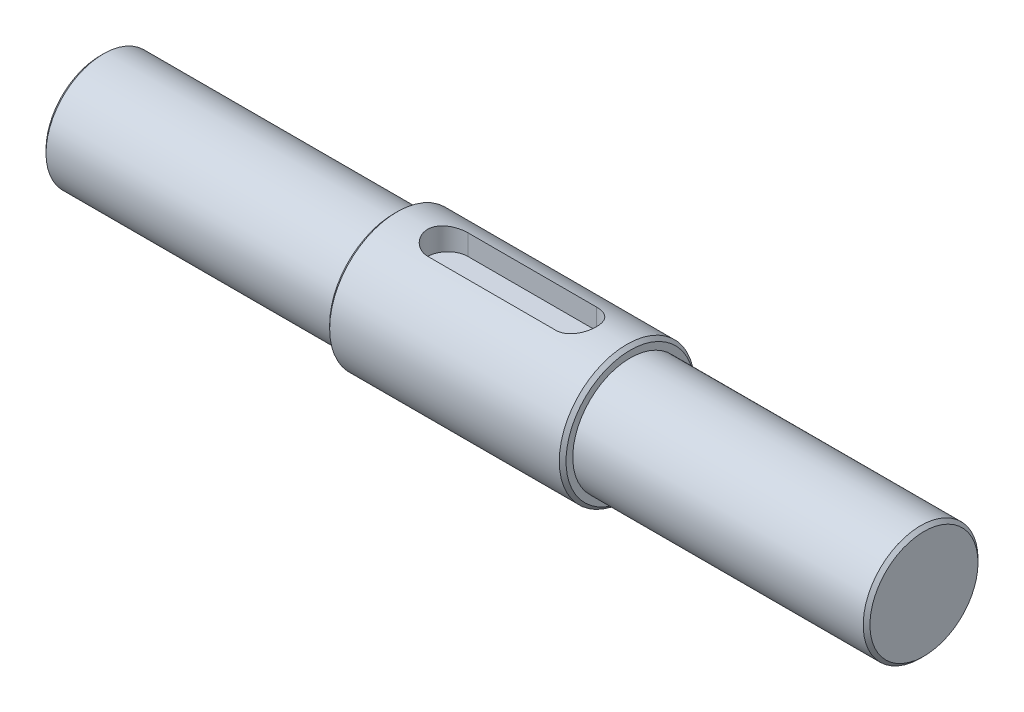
ISO-10303-21;
HEADER;
FILE_DESCRIPTION(('STEP AP214'),'2;1');
FILE_NAME('part.step','',(''),(''),'','','');
FILE_SCHEMA(('AUTOMOTIVE_DESIGN { 1 0 10303 214 1 1 1 1 }'));
ENDSEC;
DATA;
#1=APPLICATION_CONTEXT('core data for automotive mechanical design processes');
#2=APPLICATION_PROTOCOL_DEFINITION('international standard','automotive_design',2000,#1);
#3=PRODUCT_CONTEXT('',#1,'mechanical');
#4=PRODUCT('Part','Part','',(#3));
#5=PRODUCT_RELATED_PRODUCT_CATEGORY('part','',(#4));
#6=PRODUCT_DEFINITION_FORMATION('','',#4);
#7=PRODUCT_DEFINITION_CONTEXT('part definition',#1,'design');
#8=PRODUCT_DEFINITION('design','',#6,#7);
#9=PRODUCT_DEFINITION_SHAPE('','',#8);
#10=(LENGTH_UNIT() NAMED_UNIT(*) SI_UNIT(.MILLI.,.METRE.));
#11=(NAMED_UNIT(*) PLANE_ANGLE_UNIT() SI_UNIT($,.RADIAN.));
#12=(NAMED_UNIT(*) SI_UNIT($,.STERADIAN.) SOLID_ANGLE_UNIT());
#13=UNCERTAINTY_MEASURE_WITH_UNIT(LENGTH_MEASURE(1.E-05),#10,'distance_accuracy_value','');
#14=(GEOMETRIC_REPRESENTATION_CONTEXT(3) GLOBAL_UNCERTAINTY_ASSIGNED_CONTEXT((#13)) GLOBAL_UNIT_ASSIGNED_CONTEXT((#10,
#11,#12)) REPRESENTATION_CONTEXT('',''));
#15=CARTESIAN_POINT('',(0.,0.,0.));
#16=DIRECTION('',(0.,0.,1.));
#17=DIRECTION('',(1.,0.,0.));
#18=AXIS2_PLACEMENT_3D('',#15,#16,#17);
#19=CARTESIAN_POINT('',(78.5,0.,0.));
#20=DIRECTION('',(-1.,0.,0.));
#21=DIRECTION('',(0.,0.,1.));
#22=AXIS2_PLACEMENT_3D('',#19,#20,#21);
#23=CYLINDRICAL_SURFACE('',#22,10.);
#24=CARTESIAN_POINT('',(44.,0.,0.));
#25=DIRECTION('',(-1.,0.,0.));
#26=DIRECTION('',(0.,0.,1.));
#27=AXIS2_PLACEMENT_3D('',#24,#25,#26);
#28=CIRCLE('',#27,10.);
#29=CARTESIAN_POINT('',(44.,0.,10.));
#30=VERTEX_POINT('',#29);
#31=EDGE_CURVE('E175',#30,#30,#28,.F.);
#32=ORIENTED_EDGE('',*,*,#31,.T.);
#33=EDGE_LOOP('',(#32));
#34=FACE_BOUND('',#33,.T.);
#35=CARTESIAN_POINT('',(78.,0.,0.));
#36=DIRECTION('',(1.,0.,0.));
#37=DIRECTION('',(0.,0.,-1.));
#38=AXIS2_PLACEMENT_3D('',#35,#36,#37);
#39=CIRCLE('',#38,10.);
#40=CARTESIAN_POINT('',(78.,0.,-10.));
#41=VERTEX_POINT('',#40);
#42=EDGE_CURVE('E179',#41,#41,#39,.F.);
#43=ORIENTED_EDGE('',*,*,#42,.T.);
#44=EDGE_LOOP('',(#43));
#45=FACE_BOUND('',#44,.T.);
#46=CARTESIAN_POINT('',(70.5,9.53939201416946,-3.));
#47=CARTESIAN_POINT('',(70.5823355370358,9.53938054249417,-3.00001027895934));
#48=CARTESIAN_POINT('',(70.6646644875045,9.54045772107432,-2.9966106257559));
#49=CARTESIAN_POINT('',(70.8286940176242,9.54470412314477,-2.98307142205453));
#50=CARTESIAN_POINT('',(70.9103947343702,9.54787287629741,-2.97293338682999));
#51=CARTESIAN_POINT('',(71.0723849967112,9.55620668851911,-2.94603139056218));
#52=CARTESIAN_POINT('',(71.1526775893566,9.56136667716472,-2.92928425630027));
#53=CARTESIAN_POINT('',(71.3114758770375,9.57351626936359,-2.88932851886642));
#54=CARTESIAN_POINT('',(71.3899815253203,9.58050592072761,-2.86611974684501));
#55=CARTESIAN_POINT('',(71.6219518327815,9.60391662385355,-2.78708502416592));
#56=CARTESIAN_POINT('',(71.77207318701,9.62279067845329,-2.72181653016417));
#57=CARTESIAN_POINT('',(72.0592304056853,9.66493287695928,-2.56814755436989));
#58=CARTESIAN_POINT('',(72.1962605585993,9.6882029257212,-2.47973703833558));
#59=CARTESIAN_POINT('',(72.4577106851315,9.73733420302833,-2.27930849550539));
#60=CARTESIAN_POINT('',(72.5816617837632,9.76325026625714,-2.16669112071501));
#61=CARTESIAN_POINT('',(72.809254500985,9.81429160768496,-1.92230070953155));
#62=CARTESIAN_POINT('',(72.9128889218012,9.83941660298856,-1.7905209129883));
#63=CARTESIAN_POINT('',(73.0989716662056,9.88667632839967,-1.50815545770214));
#64=CARTESIAN_POINT('',(73.1809274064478,9.90873687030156,-1.35723196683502));
#65=CARTESIAN_POINT('',(73.3180322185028,9.94670462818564,-1.0430686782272));
#66=CARTESIAN_POINT('',(73.3732138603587,9.96261931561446,-0.879844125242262));
#67=CARTESIAN_POINT('',(73.44253583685,9.98287579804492,-0.596548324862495));
#68=CARTESIAN_POINT('',(73.4640437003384,9.98926260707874,-0.478373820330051));
#69=CARTESIAN_POINT('',(73.4927780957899,9.99782637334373,-0.240148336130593));
#70=CARTESIAN_POINT('',(73.5000051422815,10.0000034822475,-0.120097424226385));
#71=CARTESIAN_POINT('',(73.4999929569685,9.99999523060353,0.164489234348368));
#72=CARTESIAN_POINT('',(73.4864191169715,9.99589991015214,0.329065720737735));
#73=CARTESIAN_POINT('',(73.4325826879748,9.97995006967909,0.653490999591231));
#74=CARTESIAN_POINT('',(73.3922962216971,9.96808860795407,0.813335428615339));
#75=CARTESIAN_POINT('',(73.2865050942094,9.93791009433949,1.12347011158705));
#76=CARTESIAN_POINT('',(73.2210439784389,9.91960419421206,1.27377634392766));
#77=CARTESIAN_POINT('',(73.0669193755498,9.87844006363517,1.56126220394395));
#78=CARTESIAN_POINT('',(72.9782550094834,9.85558166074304,1.69844133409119));
#79=CARTESIAN_POINT('',(72.7775549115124,9.80701538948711,1.95973986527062));
#80=CARTESIAN_POINT('',(72.66497372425,9.78124908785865,2.08342941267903));
#81=CARTESIAN_POINT('',(72.4207873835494,9.73011795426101,2.31049322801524));
#82=CARTESIAN_POINT('',(72.2891780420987,9.70475321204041,2.41386301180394));
#83=CARTESIAN_POINT('',(72.0070161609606,9.65667462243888,2.59963060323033));
#84=CARTESIAN_POINT('',(71.8561002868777,9.63403435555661,2.68149682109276));
#85=CARTESIAN_POINT('',(71.5418990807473,9.59486058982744,2.81846673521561));
#86=CARTESIAN_POINT('',(71.3786248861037,9.57832166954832,2.87359420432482));
#87=CARTESIAN_POINT('',(71.0954604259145,9.5572566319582,2.94274437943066));
#88=CARTESIAN_POINT('',(70.9774850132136,9.5506065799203,2.96417022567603));
#89=CARTESIAN_POINT('',(70.7396975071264,9.5416523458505,2.9928130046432));
#90=CARTESIAN_POINT('',(70.6198859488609,9.539346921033,3.0000340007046));
#91=CARTESIAN_POINT('',(70.5,9.53939201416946,3.));
#92=B_SPLINE_CURVE_WITH_KNOTS('',3,(#46,#47,#48,#49,#50,#51,#52,#53,#54,#55,#56,#57,#58,#59,#60,
#61,#62,#63,#64,#65,#66,#67,#68,#69,#70,#71,#72,#73,#74,#75,#76,#77,#78,#79,#80,#81,#82,#83,#84,
#85,#86,#87,#88,#89,#90,#91),.UNSPECIFIED.,.F.,.F.,(4,2,2,2,2,2,2,2,2,2,2,2,2,2,2,2,2,2,2,2,2,2,
4),(0.,0.24691819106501,0.493780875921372,0.740019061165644,0.986263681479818,1.47814125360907,
1.9702324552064,2.47630442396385,2.9825553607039,3.49947665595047,4.01576754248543,
4.37574541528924,4.73571031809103,5.22872964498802,5.72219025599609,6.2148011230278,
6.70743065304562,7.21280916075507,7.71829906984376,8.23530810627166,8.75185663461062,
9.11124123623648,9.47052301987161),.UNSPECIFIED.);
#93=CARTESIAN_POINT('',(70.5,9.53939201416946,-3.));
#94=VERTEX_POINT('',#93);
#95=CARTESIAN_POINT('',(70.5,9.53939201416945,3.));
#96=VERTEX_POINT('',#95);
#97=EDGE_CURVE('E98',#94,#96,#92,.T.);
#98=ORIENTED_EDGE('',*,*,#97,.T.);
#99=DIRECTION('',(-1.,0.,0.));
#100=VECTOR('',#99,1.);
#101=CARTESIAN_POINT('',(61.,9.53939201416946,3.));
#102=LINE('',#101,#100);
#103=CARTESIAN_POINT('',(51.5,9.53939201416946,3.));
#104=VERTEX_POINT('',#103);
#105=EDGE_CURVE('E123',#96,#104,#102,.T.);
#106=ORIENTED_EDGE('',*,*,#105,.T.);
#107=CARTESIAN_POINT('',(51.5,9.53939201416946,3.));
#108=CARTESIAN_POINT('',(51.4176644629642,9.53938054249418,3.00001027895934));
#109=CARTESIAN_POINT('',(51.3353355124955,9.54045772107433,2.99661062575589));
#110=CARTESIAN_POINT('',(51.1713059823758,9.54470412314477,2.98307142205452));
#111=CARTESIAN_POINT('',(51.0896052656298,9.54787287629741,2.97293338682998));
#112=CARTESIAN_POINT('',(50.9276150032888,9.55620668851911,2.94603139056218));
#113=CARTESIAN_POINT('',(50.8473224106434,9.56136667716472,2.92928425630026));
#114=CARTESIAN_POINT('',(50.6885241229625,9.5735162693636,2.88932851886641));
#115=CARTESIAN_POINT('',(50.6100184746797,9.58050592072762,2.866119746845));
#116=CARTESIAN_POINT('',(50.3780481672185,9.60391662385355,2.78708502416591));
#117=CARTESIAN_POINT('',(50.22792681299,9.6227906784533,2.72181653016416));
#118=CARTESIAN_POINT('',(49.9407695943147,9.66493287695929,2.56814755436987));
#119=CARTESIAN_POINT('',(49.8037394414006,9.68820292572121,2.47973703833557));
#120=CARTESIAN_POINT('',(49.5422893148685,9.73733420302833,2.27930849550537));
#121=CARTESIAN_POINT('',(49.4183382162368,9.76325026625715,2.16669112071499));
#122=CARTESIAN_POINT('',(49.190745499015,9.81429160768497,1.92230070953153));
#123=CARTESIAN_POINT('',(49.0871110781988,9.83941660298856,1.79052091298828));
#124=CARTESIAN_POINT('',(48.9010283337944,9.88667632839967,1.50815545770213));
#125=CARTESIAN_POINT('',(48.8190725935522,9.90873687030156,1.35723196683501));
#126=CARTESIAN_POINT('',(48.6819677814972,9.94670462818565,1.0430686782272));
#127=CARTESIAN_POINT('',(48.6267861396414,9.96261931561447,0.879844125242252));
#128=CARTESIAN_POINT('',(48.55746416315,9.98287579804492,0.596548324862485));
#129=CARTESIAN_POINT('',(48.5359562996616,9.98926260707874,0.478373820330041));
#130=CARTESIAN_POINT('',(48.5072219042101,9.99782637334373,0.240148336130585));
#131=CARTESIAN_POINT('',(48.4999948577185,10.0000034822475,0.120097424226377));
#132=CARTESIAN_POINT('',(48.5000070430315,9.99999523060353,-0.164489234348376));
#133=CARTESIAN_POINT('',(48.5135808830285,9.99589991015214,-0.329065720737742));
#134=CARTESIAN_POINT('',(48.5674173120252,9.97995006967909,-0.653490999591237));
#135=CARTESIAN_POINT('',(48.607703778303,9.96808860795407,-0.813335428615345));
#136=CARTESIAN_POINT('',(48.7134949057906,9.93791009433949,-1.12347011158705));
#137=CARTESIAN_POINT('',(48.7789560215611,9.91960419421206,-1.27377634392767));
#138=CARTESIAN_POINT('',(48.9330806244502,9.87844006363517,-1.56126220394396));
#139=CARTESIAN_POINT('',(49.0217449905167,9.85558166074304,-1.69844133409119));
#140=CARTESIAN_POINT('',(49.2224450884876,9.80701538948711,-1.95973986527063));
#141=CARTESIAN_POINT('',(49.33502627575,9.78124908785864,-2.08342941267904));
#142=CARTESIAN_POINT('',(49.5792126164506,9.73011795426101,-2.31049322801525));
#143=CARTESIAN_POINT('',(49.7108219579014,9.70475321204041,-2.41386301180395));
#144=CARTESIAN_POINT('',(49.9929838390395,9.65667462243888,-2.59963060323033));
#145=CARTESIAN_POINT('',(50.1438997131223,9.63403435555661,-2.68149682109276));
#146=CARTESIAN_POINT('',(50.4581009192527,9.59486058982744,-2.81846673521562));
#147=CARTESIAN_POINT('',(50.6213751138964,9.57832166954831,-2.87359420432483));
#148=CARTESIAN_POINT('',(50.9045395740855,9.5572566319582,-2.94274437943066));
#149=CARTESIAN_POINT('',(51.0225149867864,9.5506065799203,-2.96417022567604));
#150=CARTESIAN_POINT('',(51.2603024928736,9.54165234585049,-2.99281300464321));
#151=CARTESIAN_POINT('',(51.3801140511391,9.539346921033,-3.00003400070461));
#152=CARTESIAN_POINT('',(51.5,9.53939201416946,-3.));
#153=B_SPLINE_CURVE_WITH_KNOTS('',3,(#107,#108,#109,#110,#111,#112,#113,#114,#115,#116,#117,
#118,#119,#120,#121,#122,#123,#124,#125,#126,#127,#128,#129,#130,#131,#132,#133,#134,#135,#136,
#137,#138,#139,#140,#141,#142,#143,#144,#145,#146,#147,#148,#149,#150,#151,#152),.UNSPECIFIED.,
.F.,.F.,(4,2,2,2,2,2,2,2,2,2,2,2,2,2,2,2,2,2,2,2,2,2,4),(0.,0.246918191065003,0.493780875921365,
0.74001906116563,0.986263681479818,1.4781412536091,1.97023245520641,2.47630442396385,
2.98255536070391,3.49947665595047,4.01576754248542,4.37574541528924,4.73571031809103,
5.22872964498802,5.72219025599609,6.21480112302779,6.70743065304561,7.21280916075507,
7.71829906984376,8.23530810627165,8.75185663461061,9.11124123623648,9.47052301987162),.UNSPECIFIED.);
#154=CARTESIAN_POINT('',(51.5,9.53939201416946,-3.));
#155=VERTEX_POINT('',#154);
#156=EDGE_CURVE('E61',#104,#155,#153,.T.);
#157=ORIENTED_EDGE('',*,*,#156,.T.);
#158=DIRECTION('',(-1.,0.,0.));
#159=VECTOR('',#158,1.);
#160=CARTESIAN_POINT('',(61.,9.53939201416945,-3.00000000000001));
#161=LINE('',#160,#159);
#162=EDGE_CURVE('E91',#155,#94,#161,.F.);
#163=ORIENTED_EDGE('',*,*,#162,.T.);
#164=EDGE_LOOP('',(#98,#106,#157,#163));
#165=FACE_BOUND('',#164,.T.);
#166=ADVANCED_FACE('F45',(#34,#45,#165),#23,.T.);
#167=CARTESIAN_POINT('',(78.5,10.,0.));
#168=DIRECTION('',(1.,0.,0.));
#169=DIRECTION('',(0.,0.,-1.));
#170=AXIS2_PLACEMENT_3D('',#167,#168,#169);
#171=PLANE('',#170);
#172=CARTESIAN_POINT('',(78.5,0.,0.));
#173=DIRECTION('',(1.,0.,0.));
#174=DIRECTION('',(0.,0.,-1.));
#175=AXIS2_PLACEMENT_3D('',#172,#173,#174);
#176=CIRCLE('',#175,9.49999999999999);
#177=CARTESIAN_POINT('',(78.5,0.,-9.49999999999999));
#178=VERTEX_POINT('',#177);
#179=EDGE_CURVE('E11',#178,#178,#176,.T.);
#180=ORIENTED_EDGE('',*,*,#179,.T.);
#181=EDGE_LOOP('',(#180));
#182=FACE_BOUND('',#181,.T.);
#183=CARTESIAN_POINT('',(78.5,0.,0.));
#184=DIRECTION('',(1.,0.,0.));
#185=DIRECTION('',(0.,0.,-1.));
#186=AXIS2_PLACEMENT_3D('',#183,#184,#185);
#187=CIRCLE('',#186,8.5);
#188=CARTESIAN_POINT('',(78.5,0.,-8.5));
#189=VERTEX_POINT('',#188);
#190=EDGE_CURVE('E198',#189,#189,#187,.T.);
#191=ORIENTED_EDGE('',*,*,#190,.F.);
#192=EDGE_LOOP('',(#191));
#193=FACE_BOUND('',#192,.T.);
#194=ADVANCED_FACE('F145',(#182,#193),#171,.T.);
#195=CARTESIAN_POINT('',(43.5,0.,0.));
#196=DIRECTION('',(-1.,0.,0.));
#197=DIRECTION('',(0.,0.,1.));
#198=AXIS2_PLACEMENT_3D('',#195,#196,#197);
#199=PLANE('',#198);
#200=CARTESIAN_POINT('',(43.5,0.,0.));
#201=DIRECTION('',(-1.,0.,0.));
#202=DIRECTION('',(0.,0.,1.));
#203=AXIS2_PLACEMENT_3D('',#200,#201,#202);
#204=CIRCLE('',#203,9.50000000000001);
#205=CARTESIAN_POINT('',(43.5,0.,9.50000000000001));
#206=VERTEX_POINT('',#205);
#207=EDGE_CURVE('E185',#206,#206,#204,.T.);
#208=ORIENTED_EDGE('',*,*,#207,.T.);
#209=EDGE_LOOP('',(#208));
#210=FACE_BOUND('',#209,.T.);
#211=CARTESIAN_POINT('',(43.5,0.,0.));
#212=DIRECTION('',(-1.,0.,0.));
#213=DIRECTION('',(0.,0.,1.));
#214=AXIS2_PLACEMENT_3D('',#211,#212,#213);
#215=CIRCLE('',#214,8.5);
#216=CARTESIAN_POINT('',(43.5,0.,8.5));
#217=VERTEX_POINT('',#216);
#218=EDGE_CURVE('E197',#217,#217,#215,.T.);
#219=ORIENTED_EDGE('',*,*,#218,.F.);
#220=EDGE_LOOP('',(#219));
#221=FACE_BOUND('',#220,.T.);
#222=ADVANCED_FACE('F151',(#210,#221),#199,.T.);
#223=CARTESIAN_POINT('',(122.,0.,0.));
#224=DIRECTION('',(-1.,0.,0.));
#225=DIRECTION('',(0.,0.,1.));
#226=AXIS2_PLACEMENT_3D('',#223,#224,#225);
#227=CYLINDRICAL_SURFACE('',#226,8.5);
#228=CARTESIAN_POINT('',(121.5,0.,0.));
#229=DIRECTION('',(1.,0.,0.));
#230=DIRECTION('',(0.,0.,-1.));
#231=AXIS2_PLACEMENT_3D('',#228,#229,#230);
#232=CIRCLE('',#231,8.5);
#233=CARTESIAN_POINT('',(121.5,0.,-8.5));
#234=VERTEX_POINT('',#233);
#235=EDGE_CURVE('E54',#234,#234,#232,.F.);
#236=ORIENTED_EDGE('',*,*,#235,.T.);
#237=EDGE_LOOP('',(#236));
#238=FACE_BOUND('',#237,.T.);
#239=ORIENTED_EDGE('',*,*,#190,.T.);
#240=EDGE_LOOP('',(#239));
#241=FACE_BOUND('',#240,.T.);
#242=ADVANCED_FACE('F255',(#238,#241),#227,.T.);
#243=CARTESIAN_POINT('',(122.,0.,0.));
#244=DIRECTION('',(1.,0.,0.));
#245=DIRECTION('',(0.,0.,-1.));
#246=AXIS2_PLACEMENT_3D('',#243,#244,#245);
#247=PLANE('',#246);
#248=CARTESIAN_POINT('',(122.,0.,0.));
#249=DIRECTION('',(1.,0.,0.));
#250=DIRECTION('',(0.,0.,-1.));
#251=AXIS2_PLACEMENT_3D('',#248,#249,#250);
#252=CIRCLE('',#251,8.00000000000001);
#253=CARTESIAN_POINT('',(122.,0.,-8.00000000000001));
#254=VERTEX_POINT('',#253);
#255=EDGE_CURVE('E172',#254,#254,#252,.T.);
#256=ORIENTED_EDGE('',*,*,#255,.T.);
#257=EDGE_LOOP('',(#256));
#258=FACE_BOUND('',#257,.T.);
#259=ADVANCED_FACE('F251',(#258),#247,.T.);
#260=CARTESIAN_POINT('',(0.,0.,0.));
#261=DIRECTION('',(1.,0.,0.));
#262=DIRECTION('',(0.,0.,-1.));
#263=AXIS2_PLACEMENT_3D('',#260,#261,#262);
#264=CYLINDRICAL_SURFACE('',#263,8.5);
#265=CARTESIAN_POINT('',(0.500000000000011,0.,0.));
#266=DIRECTION('',(-1.,0.,0.));
#267=DIRECTION('',(0.,0.,1.));
#268=AXIS2_PLACEMENT_3D('',#265,#266,#267);
#269=CIRCLE('',#268,8.5);
#270=CARTESIAN_POINT('',(0.500000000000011,0.,8.5));
#271=VERTEX_POINT('',#270);
#272=EDGE_CURVE('E189',#271,#271,#269,.F.);
#273=ORIENTED_EDGE('',*,*,#272,.T.);
#274=EDGE_LOOP('',(#273));
#275=FACE_BOUND('',#274,.T.);
#276=ORIENTED_EDGE('',*,*,#218,.T.);
#277=EDGE_LOOP('',(#276));
#278=FACE_BOUND('',#277,.T.);
#279=ADVANCED_FACE('F247',(#275,#278),#264,.T.);
#280=CARTESIAN_POINT('',(0.,0.,0.));
#281=DIRECTION('',(-1.,0.,0.));
#282=DIRECTION('',(0.,0.,1.));
#283=AXIS2_PLACEMENT_3D('',#280,#281,#282);
#284=PLANE('',#283);
#285=CARTESIAN_POINT('',(0.,0.,0.));
#286=DIRECTION('',(-1.,0.,0.));
#287=DIRECTION('',(0.,0.,1.));
#288=AXIS2_PLACEMENT_3D('',#285,#286,#287);
#289=CIRCLE('',#288,8.00000000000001);
#290=CARTESIAN_POINT('',(0.,0.,8.00000000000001));
#291=VERTEX_POINT('',#290);
#292=EDGE_CURVE('E193',#291,#291,#289,.T.);
#293=ORIENTED_EDGE('',*,*,#292,.T.);
#294=EDGE_LOOP('',(#293));
#295=FACE_BOUND('',#294,.T.);
#296=ADVANCED_FACE('F244',(#295),#284,.T.);
#297=CARTESIAN_POINT('',(70.5,10.001,0.));
#298=DIRECTION('',(0.,-1.,0.));
#299=DIRECTION('',(0.,0.,-1.));
#300=AXIS2_PLACEMENT_3D('',#297,#298,#299);
#301=CYLINDRICAL_SURFACE('',#300,3.);
#302=ORIENTED_EDGE('',*,*,#97,.F.);
#303=DIRECTION('',(0.,-1.,0.));
#304=VECTOR('',#303,1.);
#305=CARTESIAN_POINT('',(70.5,10.001,-3.));
#306=LINE('',#305,#304);
#307=CARTESIAN_POINT('',(70.5,6.50000000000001,-3.));
#308=VERTEX_POINT('',#307);
#309=EDGE_CURVE('E88',#94,#308,#306,.T.);
#310=ORIENTED_EDGE('',*,*,#309,.T.);
#311=CARTESIAN_POINT('',(70.5,6.50000000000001,0.));
#312=DIRECTION('',(0.,-1.,0.));
#313=DIRECTION('',(0.,0.,-1.));
#314=AXIS2_PLACEMENT_3D('',#311,#312,#313);
#315=CIRCLE('',#314,3.);
#316=CARTESIAN_POINT('',(70.5,6.50000000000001,3.));
#317=VERTEX_POINT('',#316);
#318=EDGE_CURVE('E208',#308,#317,#315,.T.);
#319=ORIENTED_EDGE('',*,*,#318,.T.);
#320=DIRECTION('',(0.,-1.,0.));
#321=VECTOR('',#320,1.);
#322=CARTESIAN_POINT('',(70.5,10.001,3.));
#323=LINE('',#322,#321);
#324=EDGE_CURVE('E69',#96,#317,#323,.T.);
#325=ORIENTED_EDGE('',*,*,#324,.F.);
#326=EDGE_LOOP('',(#302,#310,#319,#325));
#327=FACE_BOUND('',#326,.T.);
#328=ADVANCED_FACE('F99',(#327),#301,.F.);
#329=CARTESIAN_POINT('',(51.5,10.001,-3.));
#330=DIRECTION('',(0.,0.,-1.));
#331=DIRECTION('',(0.,1.,0.));
#332=AXIS2_PLACEMENT_3D('',#329,#330,#331);
#333=PLANE('',#332);
#334=ORIENTED_EDGE('',*,*,#162,.F.);
#335=DIRECTION('',(0.,-1.,0.));
#336=VECTOR('',#335,1.);
#337=CARTESIAN_POINT('',(51.5,10.001,-3.));
#338=LINE('',#337,#336);
#339=CARTESIAN_POINT('',(51.5,6.50000000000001,-3.));
#340=VERTEX_POINT('',#339);
#341=EDGE_CURVE('E209',#155,#340,#338,.T.);
#342=ORIENTED_EDGE('',*,*,#341,.T.);
#343=DIRECTION('',(1.,0.,0.));
#344=VECTOR('',#343,1.);
#345=CARTESIAN_POINT('',(51.5,6.50000000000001,-3.));
#346=LINE('',#345,#344);
#347=EDGE_CURVE('E93',#340,#308,#346,.T.);
#348=ORIENTED_EDGE('',*,*,#347,.T.);
#349=ORIENTED_EDGE('',*,*,#309,.F.);
#350=EDGE_LOOP('',(#334,#342,#348,#349));
#351=FACE_BOUND('',#350,.T.);
#352=ADVANCED_FACE('F89',(#351),#333,.F.);
#353=CARTESIAN_POINT('',(51.5,10.001,0.));
#354=DIRECTION('',(0.,-1.,0.));
#355=DIRECTION('',(0.,0.,-1.));
#356=AXIS2_PLACEMENT_3D('',#353,#354,#355);
#357=CYLINDRICAL_SURFACE('',#356,3.);
#358=ORIENTED_EDGE('',*,*,#156,.F.);
#359=DIRECTION('',(0.,-1.,0.));
#360=VECTOR('',#359,1.);
#361=CARTESIAN_POINT('',(51.5,10.001,3.));
#362=LINE('',#361,#360);
#363=CARTESIAN_POINT('',(51.5,6.50000000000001,3.));
#364=VERTEX_POINT('',#363);
#365=EDGE_CURVE('E205',#104,#364,#362,.T.);
#366=ORIENTED_EDGE('',*,*,#365,.T.);
#367=CARTESIAN_POINT('',(51.5,6.50000000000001,0.));
#368=DIRECTION('',(0.,-1.,0.));
#369=DIRECTION('',(0.,0.,-1.));
#370=AXIS2_PLACEMENT_3D('',#367,#368,#369);
#371=CIRCLE('',#370,3.);
#372=EDGE_CURVE('E228',#364,#340,#371,.T.);
#373=ORIENTED_EDGE('',*,*,#372,.T.);
#374=ORIENTED_EDGE('',*,*,#341,.F.);
#375=EDGE_LOOP('',(#358,#366,#373,#374));
#376=FACE_BOUND('',#375,.T.);
#377=ADVANCED_FACE('F142',(#376),#357,.F.);
#378=CARTESIAN_POINT('',(70.5,10.001,3.));
#379=DIRECTION('',(0.,0.,1.));
#380=DIRECTION('',(0.,-1.,0.));
#381=AXIS2_PLACEMENT_3D('',#378,#379,#380);
#382=PLANE('',#381);
#383=ORIENTED_EDGE('',*,*,#105,.F.);
#384=ORIENTED_EDGE('',*,*,#324,.T.);
#385=DIRECTION('',(-1.,0.,0.));
#386=VECTOR('',#385,1.);
#387=CARTESIAN_POINT('',(70.5,6.50000000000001,3.));
#388=LINE('',#387,#386);
#389=EDGE_CURVE('E225',#317,#364,#388,.T.);
#390=ORIENTED_EDGE('',*,*,#389,.T.);
#391=ORIENTED_EDGE('',*,*,#365,.F.);
#392=EDGE_LOOP('',(#383,#384,#390,#391));
#393=FACE_BOUND('',#392,.T.);
#394=ADVANCED_FACE('F133',(#393),#382,.F.);
#395=CARTESIAN_POINT('',(70.5,6.50000000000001,0.));
#396=DIRECTION('',(0.,-1.,0.));
#397=DIRECTION('',(0.,0.,-1.));
#398=AXIS2_PLACEMENT_3D('',#395,#396,#397);
#399=PLANE('',#398);
#400=ORIENTED_EDGE('',*,*,#318,.F.);
#401=ORIENTED_EDGE('',*,*,#347,.F.);
#402=ORIENTED_EDGE('',*,*,#372,.F.);
#403=ORIENTED_EDGE('',*,*,#389,.F.);
#404=EDGE_LOOP('',(#400,#401,#402,#403));
#405=FACE_BOUND('',#404,.T.);
#406=ADVANCED_FACE('F130',(#405),#399,.F.);
#407=CARTESIAN_POINT('',(0.,0.,0.));
#408=DIRECTION('',(1.,0.,0.));
#409=DIRECTION('',(0.,0.,-1.));
#410=AXIS2_PLACEMENT_3D('',#407,#408,#409);
#411=CONICAL_SURFACE('',#410,8.00000000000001,0.785398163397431);
#412=ORIENTED_EDGE('',*,*,#272,.F.);
#413=EDGE_LOOP('',(#412));
#414=FACE_BOUND('',#413,.T.);
#415=ORIENTED_EDGE('',*,*,#292,.F.);
#416=EDGE_LOOP('',(#415));
#417=FACE_BOUND('',#416,.T.);
#418=ADVANCED_FACE('F132',(#414,#417),#411,.T.);
#419=CARTESIAN_POINT('',(43.5,0.,0.));
#420=DIRECTION('',(1.,0.,0.));
#421=DIRECTION('',(0.,0.,-1.));
#422=AXIS2_PLACEMENT_3D('',#419,#420,#421);
#423=CONICAL_SURFACE('',#422,9.50000000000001,0.785398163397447);
#424=ORIENTED_EDGE('',*,*,#31,.F.);
#425=EDGE_LOOP('',(#424));
#426=FACE_BOUND('',#425,.T.);
#427=ORIENTED_EDGE('',*,*,#207,.F.);
#428=EDGE_LOOP('',(#427));
#429=FACE_BOUND('',#428,.T.);
#430=ADVANCED_FACE('F139',(#426,#429),#423,.T.);
#431=CARTESIAN_POINT('',(122.,0.,0.));
#432=DIRECTION('',(-1.,0.,0.));
#433=DIRECTION('',(0.,0.,1.));
#434=AXIS2_PLACEMENT_3D('',#431,#432,#433);
#435=CONICAL_SURFACE('',#434,8.00000000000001,0.785398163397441);
#436=ORIENTED_EDGE('',*,*,#235,.F.);
#437=EDGE_LOOP('',(#436));
#438=FACE_BOUND('',#437,.T.);
#439=ORIENTED_EDGE('',*,*,#255,.F.);
#440=EDGE_LOOP('',(#439));
#441=FACE_BOUND('',#440,.T.);
#442=ADVANCED_FACE('F159',(#438,#441),#435,.T.);
#443=CARTESIAN_POINT('',(78.,0.,0.));
#444=DIRECTION('',(-1.,0.,0.));
#445=DIRECTION('',(0.,0.,1.));
#446=AXIS2_PLACEMENT_3D('',#443,#444,#445);
#447=CONICAL_SURFACE('',#446,10.,0.785398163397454);
#448=ORIENTED_EDGE('',*,*,#179,.F.);
#449=EDGE_LOOP('',(#448));
#450=FACE_BOUND('',#449,.T.);
#451=ORIENTED_EDGE('',*,*,#42,.F.);
#452=EDGE_LOOP('',(#451));
#453=FACE_BOUND('',#452,.T.);
#454=ADVANCED_FACE('F47',(#450,#453),#447,.T.);
#455=CLOSED_SHELL('',(#166,#194,#222,#242,#259,#279,#296,#328,#352,#377,#394,#406,#418,#430,
#442,#454));
#456=MANIFOLD_SOLID_BREP('B2',#455);
#457=ADVANCED_BREP_SHAPE_REPRESENTATION('',(#18,#456),#14);
#458=SHAPE_DEFINITION_REPRESENTATION(#9,#457);
ENDSEC;
END-ISO-10303-21;
